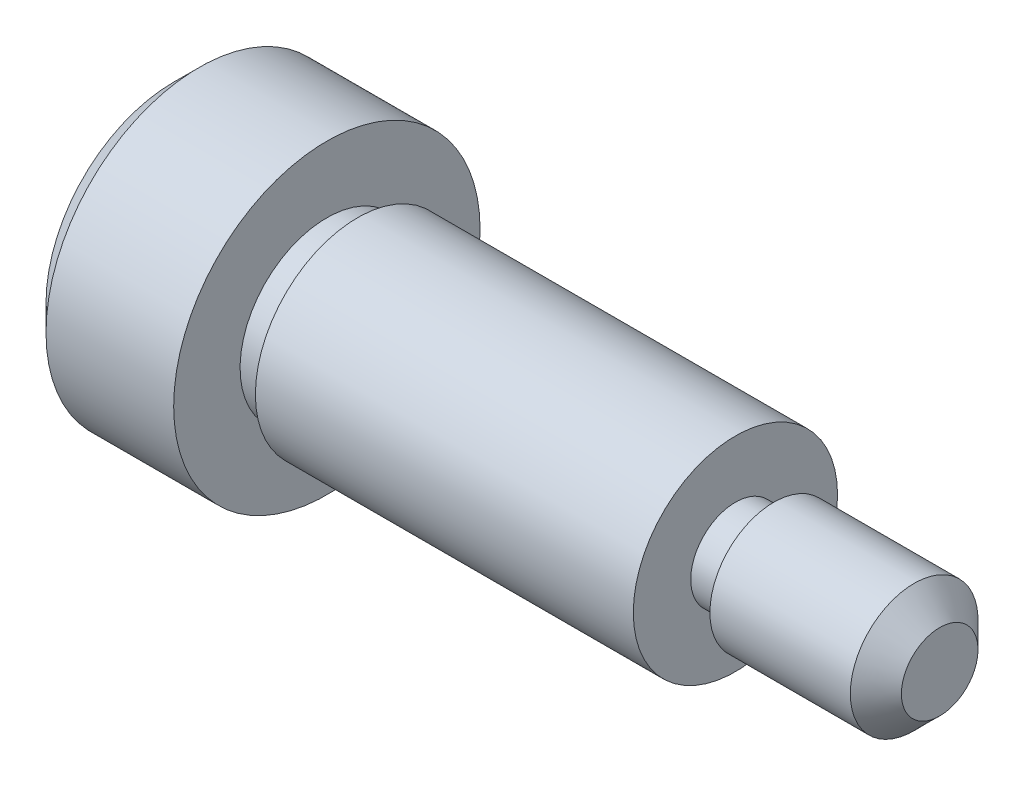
from build123d import *

# Parameters (mm, degrees)
UNDERCUT_SKETCH_W   = 0.6
UNDERCUT_SKETCH_H   = 0.3
UNDERCUT_SKETCH_W_2 = 0.75
UNDERCUT_SKETCH_H_2 = 0.375
HEX_SOCKET_DEPTH    = 1.6
CHAMFER_2_SIZE      = 0.5


with BuildPart() as part:
    # body sketch → body (revolve)
    with BuildSketch(Plane.XY, mode=Mode.PRIVATE) as body_sk:
        Polygon((-3, 0), (12, 0), (12, 1.25), (8, 1.25), (8, 2), (0, 2), (0, 3), (-3, 3), align=None)
    revolve(body_sk.sketch.rotate(Axis((0, 0, 0), (1, 0, 0)), 90), axis=Axis((0, 0, 0), (1, 0, 0)))

    # undercut sketch → undercut (revolve, cut)
    with BuildSketch(Plane.XY, mode=Mode.PRIVATE) as undercut_sk:
        with Locations((0.3, 1.85)):
            Rectangle(UNDERCUT_SKETCH_W, UNDERCUT_SKETCH_H)
        with Locations((8.375, 1.0625)):
            Rectangle(UNDERCUT_SKETCH_W_2, UNDERCUT_SKETCH_H_2)
    revolve(undercut_sk.sketch.rotate(Axis((0, 0, 0), (1, 0, 0)), 90), axis=Axis((0, 0, 0), (1, 0, 0)), mode=Mode.SUBTRACT)

    # hex socket sketch → hex socket (cut)
    with BuildSketch(Plane.ZY.offset(3)):
        Polygon((0.577350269, 1), (-0.577350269, 1), (-1.154700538, 0), (-0.577350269, -1), (0.577350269, -1), (1.154700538, 0), align=None)
    extrude(amount=-HEX_SOCKET_DEPTH, mode=Mode.SUBTRACT)

    # Chamfer 2
    chamfer_2_edges = [part.edges().sort_by_distance(p)[0] for p in [
        (12, 0, -1.25),
        (-3, 0, -3),
    ]]
    chamfer(chamfer_2_edges, length=CHAMFER_2_SIZE)


solid = part.part
